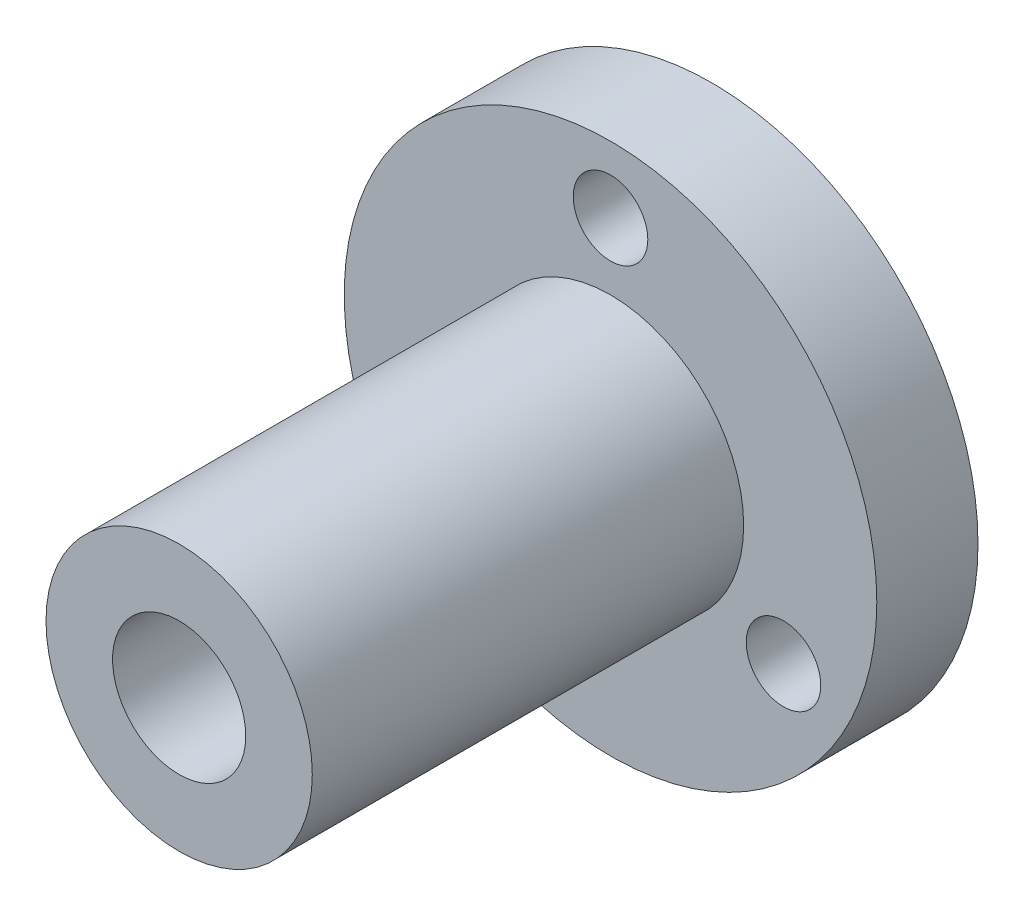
ISO-10303-21;
HEADER;
FILE_DESCRIPTION(('STEP AP214'),'2;1');
FILE_NAME('part.step','',(''),(''),'','','');
FILE_SCHEMA(('AUTOMOTIVE_DESIGN { 1 0 10303 214 1 1 1 1 }'));
ENDSEC;
DATA;
#1=APPLICATION_CONTEXT('core data for automotive mechanical design processes');
#2=APPLICATION_PROTOCOL_DEFINITION('international standard','automotive_design',2000,#1);
#3=PRODUCT_CONTEXT('',#1,'mechanical');
#4=PRODUCT('Part','Part','',(#3));
#5=PRODUCT_RELATED_PRODUCT_CATEGORY('part','',(#4));
#6=PRODUCT_DEFINITION_FORMATION('','',#4);
#7=PRODUCT_DEFINITION_CONTEXT('part definition',#1,'design');
#8=PRODUCT_DEFINITION('design','',#6,#7);
#9=PRODUCT_DEFINITION_SHAPE('','',#8);
#10=(LENGTH_UNIT() NAMED_UNIT(*) SI_UNIT(.MILLI.,.METRE.));
#11=(NAMED_UNIT(*) PLANE_ANGLE_UNIT() SI_UNIT($,.RADIAN.));
#12=(NAMED_UNIT(*) SI_UNIT($,.STERADIAN.) SOLID_ANGLE_UNIT());
#13=UNCERTAINTY_MEASURE_WITH_UNIT(LENGTH_MEASURE(1.E-05),#10,'distance_accuracy_value','');
#14=(GEOMETRIC_REPRESENTATION_CONTEXT(3) GLOBAL_UNCERTAINTY_ASSIGNED_CONTEXT((#13)) GLOBAL_UNIT_ASSIGNED_CONTEXT((#10,
#11,#12)) REPRESENTATION_CONTEXT('',''));
#15=CARTESIAN_POINT('',(0.,0.,0.));
#16=DIRECTION('',(0.,0.,1.));
#17=DIRECTION('',(1.,0.,0.));
#18=AXIS2_PLACEMENT_3D('',#15,#16,#17);
#19=CARTESIAN_POINT('',(0.,0.,0.));
#20=DIRECTION('',(0.,0.,-1.));
#21=DIRECTION('',(-1.,0.,0.));
#22=AXIS2_PLACEMENT_3D('',#19,#20,#21);
#23=PLANE('',#22);
#24=CARTESIAN_POINT('',(0.,9.525,0.));
#25=DIRECTION('',(0.,0.,1.));
#26=DIRECTION('',(1.,0.,0.));
#27=AXIS2_PLACEMENT_3D('',#24,#25,#26);
#28=CIRCLE('',#27,1.778);
#29=CARTESIAN_POINT('',(1.778,9.525,0.));
#30=VERTEX_POINT('',#29);
#31=EDGE_CURVE('E45',#30,#30,#28,.T.);
#32=ORIENTED_EDGE('',*,*,#31,.T.);
#33=EDGE_LOOP('',(#32));
#34=FACE_BOUND('',#33,.T.);
#35=CARTESIAN_POINT('',(8.24889197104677,-4.7625,0.));
#36=DIRECTION('',(0.,0.,1.));
#37=DIRECTION('',(1.,0.,0.));
#38=AXIS2_PLACEMENT_3D('',#35,#36,#37);
#39=CIRCLE('',#38,1.778);
#40=CARTESIAN_POINT('',(10.0268919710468,-4.7625,0.));
#41=VERTEX_POINT('',#40);
#42=EDGE_CURVE('E48',#41,#41,#39,.T.);
#43=ORIENTED_EDGE('',*,*,#42,.T.);
#44=EDGE_LOOP('',(#43));
#45=FACE_BOUND('',#44,.T.);
#46=CARTESIAN_POINT('',(-8.24889197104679,-4.7625,0.));
#47=DIRECTION('',(0.,0.,1.));
#48=DIRECTION('',(1.,0.,0.));
#49=AXIS2_PLACEMENT_3D('',#46,#47,#48);
#50=CIRCLE('',#49,1.778);
#51=CARTESIAN_POINT('',(-6.47089197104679,-4.7625,0.));
#52=VERTEX_POINT('',#51);
#53=EDGE_CURVE('E51',#52,#52,#50,.T.);
#54=ORIENTED_EDGE('',*,*,#53,.T.);
#55=EDGE_LOOP('',(#54));
#56=FACE_BOUND('',#55,.T.);
#57=CARTESIAN_POINT('',(0.,0.,0.));
#58=DIRECTION('',(0.,0.,1.));
#59=DIRECTION('',(1.,0.,0.));
#60=AXIS2_PLACEMENT_3D('',#57,#58,#59);
#61=CIRCLE('',#60,3.175);
#62=CARTESIAN_POINT('',(3.175,0.,0.));
#63=VERTEX_POINT('',#62);
#64=EDGE_CURVE('E19',#63,#63,#61,.T.);
#65=ORIENTED_EDGE('',*,*,#64,.T.);
#66=EDGE_LOOP('',(#65));
#67=FACE_BOUND('',#66,.T.);
#68=CARTESIAN_POINT('',(0.,0.,0.));
#69=DIRECTION('',(0.,0.,1.));
#70=DIRECTION('',(1.,0.,0.));
#71=AXIS2_PLACEMENT_3D('',#68,#69,#70);
#72=CIRCLE('',#71,12.7);
#73=CARTESIAN_POINT('',(12.7,0.,0.));
#74=VERTEX_POINT('',#73);
#75=EDGE_CURVE('E53',#74,#74,#72,.T.);
#76=ORIENTED_EDGE('',*,*,#75,.F.);
#77=EDGE_LOOP('',(#76));
#78=FACE_BOUND('',#77,.T.);
#79=ADVANCED_FACE('F15',(#34,#45,#56,#67,#78),#23,.T.);
#80=CARTESIAN_POINT('',(0.,0.,0.));
#81=DIRECTION('',(0.,0.,1.));
#82=DIRECTION('',(1.,0.,0.));
#83=AXIS2_PLACEMENT_3D('',#80,#81,#82);
#84=CYLINDRICAL_SURFACE('',#83,3.175);
#85=ORIENTED_EDGE('',*,*,#64,.F.);
#86=EDGE_LOOP('',(#85));
#87=FACE_BOUND('',#86,.T.);
#88=CARTESIAN_POINT('',(0.,0.,25.4));
#89=DIRECTION('',(0.,0.,1.));
#90=DIRECTION('',(1.,0.,0.));
#91=AXIS2_PLACEMENT_3D('',#88,#89,#90);
#92=CIRCLE('',#91,3.175);
#93=CARTESIAN_POINT('',(3.175,0.,25.4));
#94=VERTEX_POINT('',#93);
#95=EDGE_CURVE('E42',#94,#94,#92,.F.);
#96=ORIENTED_EDGE('',*,*,#95,.F.);
#97=EDGE_LOOP('',(#96));
#98=FACE_BOUND('',#97,.T.);
#99=ADVANCED_FACE('F62',(#87,#98),#84,.F.);
#100=CARTESIAN_POINT('',(0.,0.,0.));
#101=DIRECTION('',(0.,0.,1.));
#102=DIRECTION('',(1.,0.,0.));
#103=AXIS2_PLACEMENT_3D('',#100,#101,#102);
#104=CYLINDRICAL_SURFACE('',#103,12.7);
#105=ORIENTED_EDGE('',*,*,#75,.T.);
#106=EDGE_LOOP('',(#105));
#107=FACE_BOUND('',#106,.T.);
#108=CARTESIAN_POINT('',(0.,0.,4.826));
#109=DIRECTION('',(0.,0.,1.));
#110=DIRECTION('',(1.,0.,0.));
#111=AXIS2_PLACEMENT_3D('',#108,#109,#110);
#112=CIRCLE('',#111,12.7);
#113=CARTESIAN_POINT('',(12.7,0.,4.826));
#114=VERTEX_POINT('',#113);
#115=EDGE_CURVE('E39',#114,#114,#112,.F.);
#116=ORIENTED_EDGE('',*,*,#115,.T.);
#117=EDGE_LOOP('',(#116));
#118=FACE_BOUND('',#117,.T.);
#119=ADVANCED_FACE('F65',(#107,#118),#104,.T.);
#120=CARTESIAN_POINT('',(-8.24889197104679,-4.7625,0.));
#121=DIRECTION('',(0.,0.,1.));
#122=DIRECTION('',(1.,0.,0.));
#123=AXIS2_PLACEMENT_3D('',#120,#121,#122);
#124=CYLINDRICAL_SURFACE('',#123,1.778);
#125=CARTESIAN_POINT('',(-8.24889197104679,-4.7625,4.826));
#126=DIRECTION('',(0.,0.,1.));
#127=DIRECTION('',(1.,0.,0.));
#128=AXIS2_PLACEMENT_3D('',#125,#126,#127);
#129=CIRCLE('',#128,1.778);
#130=CARTESIAN_POINT('',(-6.47089197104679,-4.7625,4.826));
#131=VERTEX_POINT('',#130);
#132=EDGE_CURVE('E36',#131,#131,#129,.T.);
#133=ORIENTED_EDGE('',*,*,#132,.T.);
#134=EDGE_LOOP('',(#133));
#135=FACE_BOUND('',#134,.T.);
#136=ORIENTED_EDGE('',*,*,#53,.F.);
#137=EDGE_LOOP('',(#136));
#138=FACE_BOUND('',#137,.T.);
#139=ADVANCED_FACE('F93',(#135,#138),#124,.F.);
#140=CARTESIAN_POINT('',(8.24889197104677,-4.7625,0.));
#141=DIRECTION('',(0.,0.,1.));
#142=DIRECTION('',(1.,0.,0.));
#143=AXIS2_PLACEMENT_3D('',#140,#141,#142);
#144=CYLINDRICAL_SURFACE('',#143,1.778);
#145=CARTESIAN_POINT('',(8.24889197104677,-4.7625,4.826));
#146=DIRECTION('',(0.,0.,1.));
#147=DIRECTION('',(1.,0.,0.));
#148=AXIS2_PLACEMENT_3D('',#145,#146,#147);
#149=CIRCLE('',#148,1.778);
#150=CARTESIAN_POINT('',(10.0268919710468,-4.7625,4.826));
#151=VERTEX_POINT('',#150);
#152=EDGE_CURVE('E33',#151,#151,#149,.T.);
#153=ORIENTED_EDGE('',*,*,#152,.T.);
#154=EDGE_LOOP('',(#153));
#155=FACE_BOUND('',#154,.T.);
#156=ORIENTED_EDGE('',*,*,#42,.F.);
#157=EDGE_LOOP('',(#156));
#158=FACE_BOUND('',#157,.T.);
#159=ADVANCED_FACE('F89',(#155,#158),#144,.F.);
#160=CARTESIAN_POINT('',(0.,9.525,0.));
#161=DIRECTION('',(0.,0.,1.));
#162=DIRECTION('',(1.,0.,0.));
#163=AXIS2_PLACEMENT_3D('',#160,#161,#162);
#164=CYLINDRICAL_SURFACE('',#163,1.778);
#165=CARTESIAN_POINT('',(0.,9.525,4.826));
#166=DIRECTION('',(0.,0.,1.));
#167=DIRECTION('',(1.,0.,0.));
#168=AXIS2_PLACEMENT_3D('',#165,#166,#167);
#169=CIRCLE('',#168,1.778);
#170=CARTESIAN_POINT('',(1.778,9.525,4.826));
#171=VERTEX_POINT('',#170);
#172=EDGE_CURVE('E28',#171,#171,#169,.T.);
#173=ORIENTED_EDGE('',*,*,#172,.T.);
#174=EDGE_LOOP('',(#173));
#175=FACE_BOUND('',#174,.T.);
#176=ORIENTED_EDGE('',*,*,#31,.F.);
#177=EDGE_LOOP('',(#176));
#178=FACE_BOUND('',#177,.T.);
#179=ADVANCED_FACE('F73',(#175,#178),#164,.F.);
#180=CARTESIAN_POINT('',(0.,0.,25.4));
#181=DIRECTION('',(0.,0.,1.));
#182=DIRECTION('',(1.,0.,0.));
#183=AXIS2_PLACEMENT_3D('',#180,#181,#182);
#184=PLANE('',#183);
#185=ORIENTED_EDGE('',*,*,#95,.T.);
#186=EDGE_LOOP('',(#185));
#187=FACE_BOUND('',#186,.T.);
#188=CARTESIAN_POINT('',(0.,0.,25.4));
#189=DIRECTION('',(0.,0.,1.));
#190=DIRECTION('',(1.,0.,0.));
#191=AXIS2_PLACEMENT_3D('',#188,#189,#190);
#192=CIRCLE('',#191,6.35);
#193=CARTESIAN_POINT('',(6.35,0.,25.4));
#194=VERTEX_POINT('',#193);
#195=EDGE_CURVE('E23',#194,#194,#192,.F.);
#196=ORIENTED_EDGE('',*,*,#195,.F.);
#197=EDGE_LOOP('',(#196));
#198=FACE_BOUND('',#197,.T.);
#199=ADVANCED_FACE('F69',(#187,#198),#184,.T.);
#200=CARTESIAN_POINT('',(0.,0.,4.826));
#201=DIRECTION('',(0.,0.,-1.));
#202=DIRECTION('',(-1.,0.,0.));
#203=AXIS2_PLACEMENT_3D('',#200,#201,#202);
#204=PLANE('',#203);
#205=CARTESIAN_POINT('',(0.,0.,4.826));
#206=DIRECTION('',(0.,0.,1.));
#207=DIRECTION('',(1.,0.,0.));
#208=AXIS2_PLACEMENT_3D('',#205,#206,#207);
#209=CIRCLE('',#208,6.35);
#210=CARTESIAN_POINT('',(6.35,0.,4.826));
#211=VERTEX_POINT('',#210);
#212=EDGE_CURVE('E10',#211,#211,#209,.T.);
#213=ORIENTED_EDGE('',*,*,#212,.F.);
#214=EDGE_LOOP('',(#213));
#215=FACE_BOUND('',#214,.T.);
#216=ORIENTED_EDGE('',*,*,#172,.F.);
#217=EDGE_LOOP('',(#216));
#218=FACE_BOUND('',#217,.T.);
#219=ORIENTED_EDGE('',*,*,#152,.F.);
#220=EDGE_LOOP('',(#219));
#221=FACE_BOUND('',#220,.T.);
#222=ORIENTED_EDGE('',*,*,#132,.F.);
#223=EDGE_LOOP('',(#222));
#224=FACE_BOUND('',#223,.T.);
#225=ORIENTED_EDGE('',*,*,#115,.F.);
#226=EDGE_LOOP('',(#225));
#227=FACE_BOUND('',#226,.T.);
#228=ADVANCED_FACE('F72',(#215,#218,#221,#224,#227),#204,.F.);
#229=CARTESIAN_POINT('',(0.,0.,0.));
#230=DIRECTION('',(0.,0.,1.));
#231=DIRECTION('',(1.,0.,0.));
#232=AXIS2_PLACEMENT_3D('',#229,#230,#231);
#233=CYLINDRICAL_SURFACE('',#232,6.35);
#234=ORIENTED_EDGE('',*,*,#212,.T.);
#235=EDGE_LOOP('',(#234));
#236=FACE_BOUND('',#235,.T.);
#237=ORIENTED_EDGE('',*,*,#195,.T.);
#238=EDGE_LOOP('',(#237));
#239=FACE_BOUND('',#238,.T.);
#240=ADVANCED_FACE('F17',(#236,#239),#233,.T.);
#241=CLOSED_SHELL('',(#79,#99,#119,#139,#159,#179,#199,#228,#240));
#242=MANIFOLD_SOLID_BREP('B1',#241);
#243=ADVANCED_BREP_SHAPE_REPRESENTATION('',(#18,#242),#14);
#244=SHAPE_DEFINITION_REPRESENTATION(#9,#243);
ENDSEC;
END-ISO-10303-21;
